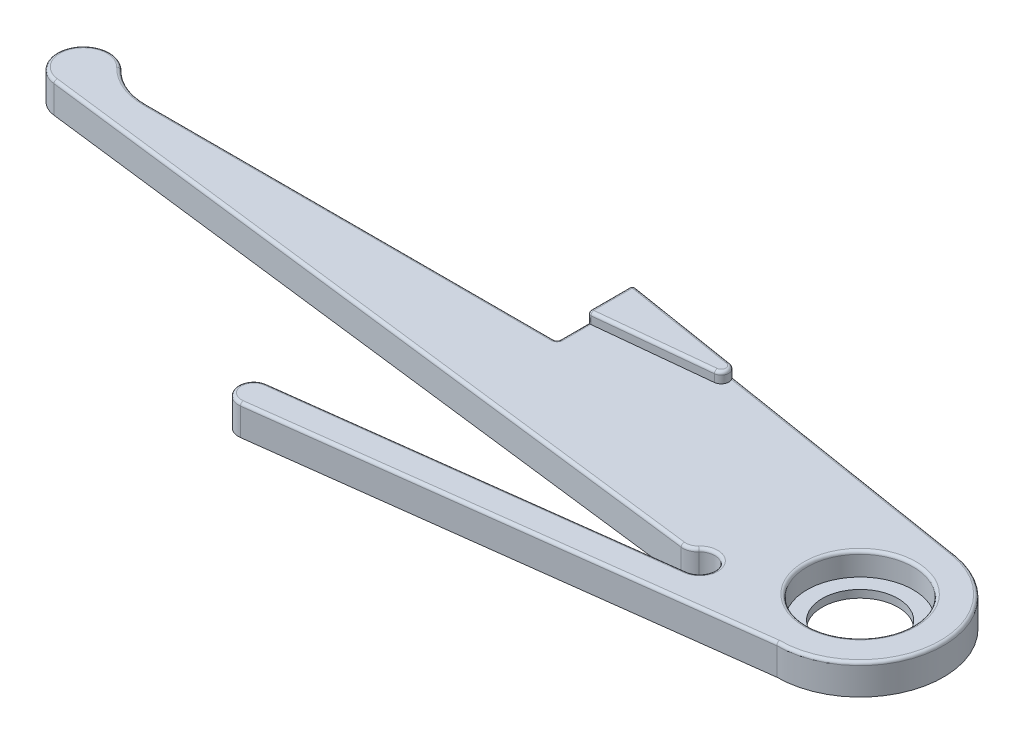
ISO-10303-21;
HEADER;
FILE_DESCRIPTION(('STEP AP214'),'2;1');
FILE_NAME('part.step','',(''),(''),'','','');
FILE_SCHEMA(('AUTOMOTIVE_DESIGN { 1 0 10303 214 1 1 1 1 }'));
ENDSEC;
DATA;
#1=APPLICATION_CONTEXT('core data for automotive mechanical design processes');
#2=APPLICATION_PROTOCOL_DEFINITION('international standard','automotive_design',2000,#1);
#3=PRODUCT_CONTEXT('',#1,'mechanical');
#4=PRODUCT('Part','Part','',(#3));
#5=PRODUCT_RELATED_PRODUCT_CATEGORY('part','',(#4));
#6=PRODUCT_DEFINITION_FORMATION('','',#4);
#7=PRODUCT_DEFINITION_CONTEXT('part definition',#1,'design');
#8=PRODUCT_DEFINITION('design','',#6,#7);
#9=PRODUCT_DEFINITION_SHAPE('','',#8);
#10=(LENGTH_UNIT() NAMED_UNIT(*) SI_UNIT(.MILLI.,.METRE.));
#11=(NAMED_UNIT(*) PLANE_ANGLE_UNIT() SI_UNIT($,.RADIAN.));
#12=(NAMED_UNIT(*) SI_UNIT($,.STERADIAN.) SOLID_ANGLE_UNIT());
#13=UNCERTAINTY_MEASURE_WITH_UNIT(LENGTH_MEASURE(1.E-05),#10,'distance_accuracy_value','');
#14=(GEOMETRIC_REPRESENTATION_CONTEXT(3) GLOBAL_UNCERTAINTY_ASSIGNED_CONTEXT((#13)) GLOBAL_UNIT_ASSIGNED_CONTEXT((#10,
#11,#12)) REPRESENTATION_CONTEXT('',''));
#15=CARTESIAN_POINT('',(0.,0.,0.));
#16=DIRECTION('',(0.,0.,1.));
#17=DIRECTION('',(1.,0.,0.));
#18=AXIS2_PLACEMENT_3D('',#15,#16,#17);
#19=CARTESIAN_POINT('',(0.,2.,0.));
#20=DIRECTION('',(0.,-1.,0.));
#21=DIRECTION('',(0.,0.,-1.));
#22=AXIS2_PLACEMENT_3D('',#19,#20,#21);
#23=CYLINDRICAL_SURFACE('',#22,2.5);
#24=CARTESIAN_POINT('',(0.,0.,0.));
#25=DIRECTION('',(0.,1.,0.));
#26=DIRECTION('',(0.,0.,1.));
#27=AXIS2_PLACEMENT_3D('',#24,#25,#26);
#28=CIRCLE('',#27,2.5);
#29=CARTESIAN_POINT('',(0.,0.,2.5));
#30=VERTEX_POINT('',#29);
#31=EDGE_CURVE('E239',#30,#30,#28,.T.);
#32=ORIENTED_EDGE('',*,*,#31,.F.);
#33=EDGE_LOOP('',(#32));
#34=FACE_BOUND('',#33,.T.);
#35=CARTESIAN_POINT('',(0.,0.5,0.));
#36=DIRECTION('',(0.,1.,0.));
#37=DIRECTION('',(0.,0.,1.));
#38=AXIS2_PLACEMENT_3D('',#35,#36,#37);
#39=CIRCLE('',#38,2.5);
#40=CARTESIAN_POINT('',(0.,0.5,2.5));
#41=VERTEX_POINT('',#40);
#42=EDGE_CURVE('E287',#41,#41,#39,.T.);
#43=ORIENTED_EDGE('',*,*,#42,.T.);
#44=EDGE_LOOP('',(#43));
#45=FACE_BOUND('',#44,.T.);
#46=ADVANCED_FACE('F37',(#34,#45),#23,.F.);
#47=CARTESIAN_POINT('',(-55.75,2.,-4.50451528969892));
#48=DIRECTION('',(0.,1.,0.));
#49=DIRECTION('',(0.,0.,1.));
#50=AXIS2_PLACEMENT_3D('',#47,#48,#49);
#51=PLANE('',#50);
#52=CARTESIAN_POINT('',(0.,2.,0.));
#53=DIRECTION('',(0.,1.,0.));
#54=DIRECTION('',(0.,0.,1.));
#55=AXIS2_PLACEMENT_3D('',#52,#53,#54);
#56=CIRCLE('',#55,3.7);
#57=CARTESIAN_POINT('',(0.,2.,3.7));
#58=VERTEX_POINT('',#57);
#59=EDGE_CURVE('E306',#58,#58,#56,.F.);
#60=ORIENTED_EDGE('',*,*,#59,.T.);
#61=EDGE_LOOP('',(#60));
#62=FACE_BOUND('',#61,.T.);
#63=CARTESIAN_POINT('',(0.,2.,0.));
#64=DIRECTION('',(0.,1.,0.));
#65=DIRECTION('',(0.,0.,1.));
#66=AXIS2_PLACEMENT_3D('',#63,#64,#65);
#67=CIRCLE('',#66,5.3);
#68=CARTESIAN_POINT('',(-0.0125778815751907,2.,5.29998507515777));
#69=VERTEX_POINT('',#68);
#70=CARTESIAN_POINT('',(0.83936984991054,2.,-5.23311171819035));
#71=VERTEX_POINT('',#70);
#72=EDGE_CURVE('E376',#69,#71,#67,.T.);
#73=ORIENTED_EDGE('',*,*,#72,.T.);
#74=DIRECTION('',(-0.987379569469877,0.,-0.158371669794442));
#75=VECTOR('',#74,1.);
#76=CARTESIAN_POINT('',(-16.8971665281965,2.,-8.07798006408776));
#77=LINE('',#76,#75);
#78=CARTESIAN_POINT('',(-16.5022147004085,2.,-8.01463139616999));
#79=VERTEX_POINT('',#78);
#80=EDGE_CURVE('E379',#71,#79,#77,.T.);
#81=ORIENTED_EDGE('',*,*,#80,.T.);
#82=CARTESIAN_POINT('',(-16.9446780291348,2.,-7.7817661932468));
#83=DIRECTION('',(0.,1.,0.));
#84=DIRECTION('',(0.,0.,1.));
#85=AXIS2_PLACEMENT_3D('',#82,#83,#84);
#86=CIRCLE('',#85,0.5);
#87=CARTESIAN_POINT('',(-16.8933893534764,2.,-7.28440367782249));
#88=VERTEX_POINT('',#87);
#89=EDGE_CURVE('E301',#79,#88,#86,.F.);
#90=ORIENTED_EDGE('',*,*,#89,.T.);
#91=DIRECTION('',(0.994725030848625,0.,-0.102577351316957));
#92=VECTOR('',#91,1.);
#93=CARTESIAN_POINT('',(-24.5,2.,-6.49999999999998));
#94=LINE('',#93,#92);
#95=CARTESIAN_POINT('',(-24.2794845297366,2.,-6.52273984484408));
#96=VERTEX_POINT('',#95);
#97=EDGE_CURVE('E290',#96,#88,#94,.T.);
#98=ORIENTED_EDGE('',*,*,#97,.F.);
#99=CARTESIAN_POINT('',(-24.3,2.,-6.7216848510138));
#100=DIRECTION('',(0.,1.,0.));
#101=DIRECTION('',(0.,0.,1.));
#102=AXIS2_PLACEMENT_3D('',#99,#100,#101);
#103=CIRCLE('',#102,0.2);
#104=CARTESIAN_POINT('',(-24.3,2.,-6.5216848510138));
#105=VERTEX_POINT('',#104);
#106=EDGE_CURVE('E321',#96,#105,#103,.F.);
#107=ORIENTED_EDGE('',*,*,#106,.T.);
#108=DIRECTION('',(0.,0.,1.));
#109=VECTOR('',#108,1.);
#110=CARTESIAN_POINT('',(-24.3,2.,-4.69999999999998));
#111=LINE('',#110,#109);
#112=CARTESIAN_POINT('',(-24.3,2.,-4.69999999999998));
#113=VERTEX_POINT('',#112);
#114=EDGE_CURVE('E374',#105,#113,#111,.T.);
#115=ORIENTED_EDGE('',*,*,#114,.T.);
#116=CARTESIAN_POINT('',(-24.7,2.,-4.69999999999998));
#117=DIRECTION('',(0.,1.,0.));
#118=DIRECTION('',(0.,0.,1.));
#119=AXIS2_PLACEMENT_3D('',#116,#117,#118);
#120=CIRCLE('',#119,0.4);
#121=CARTESIAN_POINT('',(-24.7,2.,-4.29999999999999));
#122=VERTEX_POINT('',#121);
#123=EDGE_CURVE('E372',#113,#122,#120,.F.);
#124=ORIENTED_EDGE('',*,*,#123,.T.);
#125=DIRECTION('',(-1.,0.,0.));
#126=VECTOR('',#125,1.);
#127=CARTESIAN_POINT('',(-51.6149544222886,2.,-4.29999999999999));
#128=LINE('',#127,#126);
#129=CARTESIAN_POINT('',(-51.6149544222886,2.,-4.29999999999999));
#130=VERTEX_POINT('',#129);
#131=EDGE_CURVE('E354',#122,#130,#128,.T.);
#132=ORIENTED_EDGE('',*,*,#131,.T.);
#133=CARTESIAN_POINT('',(-51.6149544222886,2.,-8.49999999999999));
#134=DIRECTION('',(0.,1.,0.));
#135=DIRECTION('',(0.,0.,1.));
#136=AXIS2_PLACEMENT_3D('',#133,#134,#135);
#137=CIRCLE('',#136,4.2);
#138=CARTESIAN_POINT('',(-54.6353355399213,2.,-5.58155899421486));
#139=VERTEX_POINT('',#138);
#140=EDGE_CURVE('E356',#130,#139,#137,.F.);
#141=ORIENTED_EDGE('',*,*,#140,.T.);
#142=CARTESIAN_POINT('',(-55.75,2.,-4.50451528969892));
#143=DIRECTION('',(0.,1.,0.));
#144=DIRECTION('',(0.,0.,1.));
#145=AXIS2_PLACEMENT_3D('',#142,#143,#144);
#146=CIRCLE('',#145,1.55);
#147=CARTESIAN_POINT('',(-55.938897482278,2.,-2.96606875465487));
#148=VERTEX_POINT('',#147);
#149=EDGE_CURVE('E358',#139,#148,#146,.T.);
#150=ORIENTED_EDGE('',*,*,#149,.T.);
#151=DIRECTION('',(0.992546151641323,0.,0.121869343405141));
#152=VECTOR('',#151,1.);
#153=CARTESIAN_POINT('',(-8.75799805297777,2.,2.82701726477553));
#154=LINE('',#153,#152);
#155=CARTESIAN_POINT('',(-8.75799805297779,2.,2.82701726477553));
#156=VERTEX_POINT('',#155);
#157=EDGE_CURVE('E360',#148,#156,#154,.T.);
#158=ORIENTED_EDGE('',*,*,#157,.T.);
#159=CARTESIAN_POINT('',(-8.66050257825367,2.,2.03298034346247));
#160=DIRECTION('',(0.,1.,0.));
#161=DIRECTION('',(0.,0.,1.));
#162=AXIS2_PLACEMENT_3D('',#159,#160,#161);
#163=CIRCLE('',#162,0.8);
#164=CARTESIAN_POINT('',(-8.07381864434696,2.,2.57685713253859));
#165=VERTEX_POINT('',#164);
#166=EDGE_CURVE('E362',#156,#165,#163,.T.);
#167=ORIENTED_EDGE('',*,*,#166,.T.);
#168=CARTESIAN_POINT('',(-7.1937927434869,2.,3.39267231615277));
#169=DIRECTION('',(0.,1.,0.));
#170=DIRECTION('',(0.,0.,1.));
#171=AXIS2_PLACEMENT_3D('',#168,#169,#170);
#172=CIRCLE('',#171,1.2);
#173=CARTESIAN_POINT('',(-7.04206439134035,2.,4.58304137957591));
#174=VERTEX_POINT('',#173);
#175=EDGE_CURVE('E364',#165,#174,#172,.F.);
#176=ORIENTED_EDGE('',*,*,#175,.T.);
#177=DIRECTION('',(-0.991974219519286,0.,0.126440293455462));
#178=VECTOR('',#177,1.);
#179=CARTESIAN_POINT('',(-31.6091780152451,2.,7.71444640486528));
#180=LINE('',#179,#178);
#181=CARTESIAN_POINT('',(-31.6091780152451,2.,7.71444640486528));
#182=VERTEX_POINT('',#181);
#183=EDGE_CURVE('E366',#174,#182,#180,.T.);
#184=ORIENTED_EDGE('',*,*,#183,.T.);
#185=CARTESIAN_POINT('',(-31.5080257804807,2.,8.50802578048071));
#186=DIRECTION('',(0.,1.,0.));
#187=DIRECTION('',(0.,0.,1.));
#188=AXIS2_PLACEMENT_3D('',#185,#186,#187);
#189=CIRCLE('',#188,0.800000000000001);
#190=CARTESIAN_POINT('',(-31.4068735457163,2.,9.30160515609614));
#191=VERTEX_POINT('',#190);
#192=EDGE_CURVE('E368',#182,#191,#189,.T.);
#193=ORIENTED_EDGE('',*,*,#192,.T.);
#194=DIRECTION('',(0.991974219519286,0.,-0.126440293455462));
#195=VECTOR('',#194,1.);
#196=CARTESIAN_POINT('',(-0.0252880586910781,2.,5.30160515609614));
#197=LINE('',#196,#195);
#198=EDGE_CURVE('E370',#191,#69,#197,.T.);
#199=ORIENTED_EDGE('',*,*,#198,.T.);
#200=EDGE_LOOP('',(#73,#81,#90,#98,#107,#115,#124,#132,#141,#150,#158,#167,#176,#184,#193,#199));
#201=FACE_BOUND('',#200,.T.);
#202=ADVANCED_FACE('F549',(#62,#201),#51,.T.);
#203=CARTESIAN_POINT('',(-55.75,0.,-4.50451528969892));
#204=DIRECTION('',(0.,1.,0.));
#205=DIRECTION('',(0.,0.,1.));
#206=AXIS2_PLACEMENT_3D('',#203,#204,#205);
#207=PLANE('',#206);
#208=DIRECTION('',(0.,0.,1.));
#209=VECTOR('',#208,1.);
#210=CARTESIAN_POINT('',(-24.5,0.,-9.49999999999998));
#211=LINE('',#210,#209);
#212=CARTESIAN_POINT('',(-24.5,0.,-9.26536446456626));
#213=VERTEX_POINT('',#212);
#214=CARTESIAN_POINT('',(-24.5,0.,-4.69999999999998));
#215=VERTEX_POINT('',#214);
#216=EDGE_CURVE('E269',#213,#215,#211,.T.);
#217=ORIENTED_EDGE('',*,*,#216,.F.);
#218=CARTESIAN_POINT('',(-24.3,0.,-9.26536446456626));
#219=DIRECTION('',(0.,1.,0.));
#220=DIRECTION('',(0.,0.,1.));
#221=AXIS2_PLACEMENT_3D('',#218,#219,#220);
#222=CIRCLE('',#221,0.2);
#223=CARTESIAN_POINT('',(-24.2683256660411,0.,-9.46284037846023));
#224=VERTEX_POINT('',#223);
#225=EDGE_CURVE('E316',#213,#224,#222,.F.);
#226=ORIENTED_EDGE('',*,*,#225,.T.);
#227=DIRECTION('',(-0.987379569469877,0.,-0.158371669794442));
#228=VECTOR('',#227,1.);
#229=CARTESIAN_POINT('',(-24.5,0.,-9.49999999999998));
#230=LINE('',#229,#228);
#231=CARTESIAN_POINT('',(0.871044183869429,0.,-5.43058763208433));
#232=VERTEX_POINT('',#231);
#233=EDGE_CURVE('E266',#232,#224,#230,.T.);
#234=ORIENTED_EDGE('',*,*,#233,.F.);
#235=CARTESIAN_POINT('',(0.,0.,0.));
#236=DIRECTION('',(0.,1.,0.));
#237=DIRECTION('',(0.,0.,1.));
#238=AXIS2_PLACEMENT_3D('',#235,#236,#237);
#239=CIRCLE('',#238,5.5);
#240=CARTESIAN_POINT('',(0.,0.,5.5));
#241=VERTEX_POINT('',#240);
#242=EDGE_CURVE('E263',#241,#232,#239,.T.);
#243=ORIENTED_EDGE('',*,*,#242,.F.);
#244=DIRECTION('',(0.991974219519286,0.,-0.126440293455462));
#245=VECTOR('',#244,1.);
#246=CARTESIAN_POINT('',(-31.3815854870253,0.,9.5));
#247=LINE('',#246,#245);
#248=CARTESIAN_POINT('',(-31.3815854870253,0.,9.5));
#249=VERTEX_POINT('',#248);
#250=EDGE_CURVE('E260',#249,#241,#247,.T.);
#251=ORIENTED_EDGE('',*,*,#250,.F.);
#252=CARTESIAN_POINT('',(-31.5080257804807,0.,8.50802578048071));
#253=DIRECTION('',(0.,1.,0.));
#254=DIRECTION('',(0.,0.,1.));
#255=AXIS2_PLACEMENT_3D('',#252,#253,#254);
#256=CIRCLE('',#255,1.);
#257=CARTESIAN_POINT('',(-31.6344660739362,0.,7.51605156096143));
#258=VERTEX_POINT('',#257);
#259=EDGE_CURVE('E257',#258,#249,#256,.T.);
#260=ORIENTED_EDGE('',*,*,#259,.F.);
#261=DIRECTION('',(-0.991974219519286,0.,0.126440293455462));
#262=VECTOR('',#261,1.);
#263=CARTESIAN_POINT('',(-7.06735245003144,0.,4.38464653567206));
#264=LINE('',#263,#262);
#265=CARTESIAN_POINT('',(-7.06735245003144,0.,4.38464653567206));
#266=VERTEX_POINT('',#265);
#267=EDGE_CURVE('E254',#266,#258,#264,.T.);
#268=ORIENTED_EDGE('',*,*,#267,.F.);
#269=CARTESIAN_POINT('',(-7.1937927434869,0.,3.39267231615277));
#270=DIRECTION('',(0.,-1.,0.));
#271=DIRECTION('',(0.,0.,-1.));
#272=AXIS2_PLACEMENT_3D('',#269,#270,#271);
#273=CIRCLE('',#272,1.);
#274=CARTESIAN_POINT('',(-7.92714766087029,0.,2.71282632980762));
#275=VERTEX_POINT('',#274);
#276=EDGE_CURVE('E248',#275,#266,#273,.T.);
#277=ORIENTED_EDGE('',*,*,#276,.F.);
#278=CARTESIAN_POINT('',(-8.66050257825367,0.,2.03298034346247));
#279=DIRECTION('',(0.,1.,0.));
#280=DIRECTION('',(0.,0.,1.));
#281=AXIS2_PLACEMENT_3D('',#278,#279,#280);
#282=CIRCLE('',#281,1.);
#283=CARTESIAN_POINT('',(-8.78237192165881,0.,3.02552649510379));
#284=VERTEX_POINT('',#283);
#285=EDGE_CURVE('E246',#284,#275,#282,.T.);
#286=ORIENTED_EDGE('',*,*,#285,.F.);
#287=DIRECTION('',(0.992546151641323,0.,0.121869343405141));
#288=VECTOR('',#287,1.);
#289=CARTESIAN_POINT('',(-55.963271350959,0.,-2.7675595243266));
#290=LINE('',#289,#288);
#291=CARTESIAN_POINT('',(-55.963271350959,0.,-2.7675595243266));
#292=VERTEX_POINT('',#291);
#293=EDGE_CURVE('E224',#292,#284,#290,.T.);
#294=ORIENTED_EDGE('',*,*,#293,.F.);
#295=CARTESIAN_POINT('',(-55.75,0.,-4.50451528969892));
#296=DIRECTION('',(0.,1.,0.));
#297=DIRECTION('',(0.,0.,1.));
#298=AXIS2_PLACEMENT_3D('',#295,#296,#297);
#299=CIRCLE('',#298,1.75);
#300=CARTESIAN_POINT('',(-54.4915078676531,0.,-5.72053237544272));
#301=VERTEX_POINT('',#300);
#302=EDGE_CURVE('E234',#301,#292,#299,.T.);
#303=ORIENTED_EDGE('',*,*,#302,.F.);
#304=CARTESIAN_POINT('',(-51.6149544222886,0.,-8.49999999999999));
#305=DIRECTION('',(0.,1.,0.));
#306=DIRECTION('',(0.,0.,1.));
#307=AXIS2_PLACEMENT_3D('',#304,#305,#306);
#308=CIRCLE('',#307,4.);
#309=CARTESIAN_POINT('',(-51.6149544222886,0.,-4.49999999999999));
#310=VERTEX_POINT('',#309);
#311=EDGE_CURVE('E295',#301,#310,#308,.T.);
#312=ORIENTED_EDGE('',*,*,#311,.T.);
#313=DIRECTION('',(-1.,0.,0.));
#314=VECTOR('',#313,1.);
#315=CARTESIAN_POINT('',(-24.5,0.,-4.49999999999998));
#316=LINE('',#315,#314);
#317=CARTESIAN_POINT('',(-24.7,0.,-4.49999999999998));
#318=VERTEX_POINT('',#317);
#319=EDGE_CURVE('E272',#318,#310,#316,.T.);
#320=ORIENTED_EDGE('',*,*,#319,.F.);
#321=CARTESIAN_POINT('',(-24.7,0.,-4.69999999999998));
#322=DIRECTION('',(0.,1.,0.));
#323=DIRECTION('',(0.,0.,1.));
#324=AXIS2_PLACEMENT_3D('',#321,#322,#323);
#325=CIRCLE('',#324,0.2);
#326=EDGE_CURVE('E329',#318,#215,#325,.T.);
#327=ORIENTED_EDGE('',*,*,#326,.T.);
#328=EDGE_LOOP('',(#217,#226,#234,#243,#251,#260,#268,#277,#286,#294,#303,#312,#320,#327));
#329=FACE_BOUND('',#328,.T.);
#330=ORIENTED_EDGE('',*,*,#31,.T.);
#331=EDGE_LOOP('',(#330));
#332=FACE_BOUND('',#331,.T.);
#333=ADVANCED_FACE('F242',(#329,#332),#207,.F.);
#334=CARTESIAN_POINT('',(-55.75,2.,-4.50451528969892));
#335=DIRECTION('',(0.,-1.,0.));
#336=DIRECTION('',(0.,0.,-1.));
#337=AXIS2_PLACEMENT_3D('',#334,#335,#336);
#338=CYLINDRICAL_SURFACE('',#337,1.75);
#339=DIRECTION('',(0.,-1.,0.));
#340=VECTOR('',#339,1.);
#341=CARTESIAN_POINT('',(-55.963271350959,2.,-2.7675595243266));
#342=LINE('',#341,#340);
#343=CARTESIAN_POINT('',(-55.963271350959,1.8,-2.7675595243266));
#344=VERTEX_POINT('',#343);
#345=EDGE_CURVE('E219',#344,#292,#342,.T.);
#346=ORIENTED_EDGE('',*,*,#345,.F.);
#347=CARTESIAN_POINT('',(-55.75,1.8,-4.50451528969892));
#348=DIRECTION('',(0.,1.,0.));
#349=DIRECTION('',(0.,0.,1.));
#350=AXIS2_PLACEMENT_3D('',#347,#348,#349);
#351=CIRCLE('',#350,1.75);
#352=CARTESIAN_POINT('',(-54.4915078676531,1.8,-5.72053237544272));
#353=VERTEX_POINT('',#352);
#354=EDGE_CURVE('E396',#344,#353,#351,.F.);
#355=ORIENTED_EDGE('',*,*,#354,.T.);
#356=DIRECTION('',(0.,-1.,0.));
#357=VECTOR('',#356,1.);
#358=CARTESIAN_POINT('',(-54.4915078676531,2.,-5.72053237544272));
#359=LINE('',#358,#357);
#360=EDGE_CURVE('E230',#353,#301,#359,.T.);
#361=ORIENTED_EDGE('',*,*,#360,.T.);
#362=ORIENTED_EDGE('',*,*,#302,.T.);
#363=EDGE_LOOP('',(#346,#355,#361,#362));
#364=FACE_BOUND('',#363,.T.);
#365=ADVANCED_FACE('F235',(#364),#338,.T.);
#366=CARTESIAN_POINT('',(-55.963271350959,2.,-2.7675595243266));
#367=DIRECTION('',(0.121869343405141,0.,-0.992546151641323));
#368=DIRECTION('',(-0.992546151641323,0.,-0.121869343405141));
#369=AXIS2_PLACEMENT_3D('',#366,#367,#368);
#370=PLANE('',#369);
#371=DIRECTION('',(0.,-1.,0.));
#372=VECTOR('',#371,1.);
#373=CARTESIAN_POINT('',(-8.78237192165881,2.,3.02552649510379));
#374=LINE('',#373,#372);
#375=CARTESIAN_POINT('',(-8.78237192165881,1.8,3.02552649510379));
#376=VERTEX_POINT('',#375);
#377=EDGE_CURVE('E231',#376,#284,#374,.T.);
#378=ORIENTED_EDGE('',*,*,#377,.F.);
#379=DIRECTION('',(0.992546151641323,0.,0.121869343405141));
#380=VECTOR('',#379,1.);
#381=CARTESIAN_POINT('',(-55.963271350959,1.8,-2.7675595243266));
#382=LINE('',#381,#380);
#383=EDGE_CURVE('E227',#376,#344,#382,.F.);
#384=ORIENTED_EDGE('',*,*,#383,.T.);
#385=ORIENTED_EDGE('',*,*,#345,.T.);
#386=ORIENTED_EDGE('',*,*,#293,.T.);
#387=EDGE_LOOP('',(#378,#384,#385,#386));
#388=FACE_BOUND('',#387,.T.);
#389=ADVANCED_FACE('F222',(#388),#370,.F.);
#390=CARTESIAN_POINT('',(-8.66050257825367,2.,2.03298034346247));
#391=DIRECTION('',(0.,-1.,0.));
#392=DIRECTION('',(0.,0.,-1.));
#393=AXIS2_PLACEMENT_3D('',#390,#391,#392);
#394=CYLINDRICAL_SURFACE('',#393,1.);
#395=DIRECTION('',(0.,-1.,0.));
#396=VECTOR('',#395,1.);
#397=CARTESIAN_POINT('',(-7.92714766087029,2.,2.71282632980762));
#398=LINE('',#397,#396);
#399=CARTESIAN_POINT('',(-7.92714766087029,1.8,2.71282632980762));
#400=VERTEX_POINT('',#399);
#401=EDGE_CURVE('E284',#400,#275,#398,.T.);
#402=ORIENTED_EDGE('',*,*,#401,.F.);
#403=CARTESIAN_POINT('',(-8.66050257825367,1.8,2.03298034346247));
#404=DIRECTION('',(0.,1.,0.));
#405=DIRECTION('',(0.,0.,1.));
#406=AXIS2_PLACEMENT_3D('',#403,#404,#405);
#407=CIRCLE('',#406,1.);
#408=EDGE_CURVE('E393',#400,#376,#407,.F.);
#409=ORIENTED_EDGE('',*,*,#408,.T.);
#410=ORIENTED_EDGE('',*,*,#377,.T.);
#411=ORIENTED_EDGE('',*,*,#285,.T.);
#412=EDGE_LOOP('',(#402,#409,#410,#411));
#413=FACE_BOUND('',#412,.T.);
#414=ADVANCED_FACE('F607',(#413),#394,.T.);
#415=CARTESIAN_POINT('',(-7.1937927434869,2.,3.39267231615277));
#416=DIRECTION('',(0.,-1.,0.));
#417=DIRECTION('',(0.,0.,-1.));
#418=AXIS2_PLACEMENT_3D('',#415,#416,#417);
#419=CYLINDRICAL_SURFACE('',#418,1.);
#420=DIRECTION('',(0.,-1.,0.));
#421=VECTOR('',#420,1.);
#422=CARTESIAN_POINT('',(-7.06735245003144,2.,4.38464653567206));
#423=LINE('',#422,#421);
#424=CARTESIAN_POINT('',(-7.06735245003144,1.8,4.38464653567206));
#425=VERTEX_POINT('',#424);
#426=EDGE_CURVE('E282',#425,#266,#423,.T.);
#427=ORIENTED_EDGE('',*,*,#426,.F.);
#428=CARTESIAN_POINT('',(-7.1937927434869,1.8,3.39267231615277));
#429=DIRECTION('',(0.,1.,0.));
#430=DIRECTION('',(0.,0.,1.));
#431=AXIS2_PLACEMENT_3D('',#428,#429,#430);
#432=CIRCLE('',#431,1.);
#433=EDGE_CURVE('E391',#425,#400,#432,.T.);
#434=ORIENTED_EDGE('',*,*,#433,.T.);
#435=ORIENTED_EDGE('',*,*,#401,.T.);
#436=ORIENTED_EDGE('',*,*,#276,.T.);
#437=EDGE_LOOP('',(#427,#434,#435,#436));
#438=FACE_BOUND('',#437,.T.);
#439=ADVANCED_FACE('F603',(#438),#419,.F.);
#440=CARTESIAN_POINT('',(-7.06735245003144,2.,4.38464653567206));
#441=DIRECTION('',(0.126440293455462,0.,0.991974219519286));
#442=DIRECTION('',(0.991974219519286,0.,-0.126440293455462));
#443=AXIS2_PLACEMENT_3D('',#440,#441,#442);
#444=PLANE('',#443);
#445=DIRECTION('',(0.,-1.,0.));
#446=VECTOR('',#445,1.);
#447=CARTESIAN_POINT('',(-31.6344660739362,2.,7.51605156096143));
#448=LINE('',#447,#446);
#449=CARTESIAN_POINT('',(-31.6344660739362,1.8,7.51605156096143));
#450=VERTEX_POINT('',#449);
#451=EDGE_CURVE('E280',#450,#258,#448,.T.);
#452=ORIENTED_EDGE('',*,*,#451,.F.);
#453=DIRECTION('',(-0.991974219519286,0.,0.126440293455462));
#454=VECTOR('',#453,1.);
#455=CARTESIAN_POINT('',(-7.06735245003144,1.8,4.38464653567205));
#456=LINE('',#455,#454);
#457=EDGE_CURVE('E389',#450,#425,#456,.F.);
#458=ORIENTED_EDGE('',*,*,#457,.T.);
#459=ORIENTED_EDGE('',*,*,#426,.T.);
#460=ORIENTED_EDGE('',*,*,#267,.T.);
#461=EDGE_LOOP('',(#452,#458,#459,#460));
#462=FACE_BOUND('',#461,.T.);
#463=ADVANCED_FACE('F599',(#462),#444,.F.);
#464=CARTESIAN_POINT('',(-31.5080257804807,2.,8.50802578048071));
#465=DIRECTION('',(0.,-1.,0.));
#466=DIRECTION('',(0.,0.,-1.));
#467=AXIS2_PLACEMENT_3D('',#464,#465,#466);
#468=CYLINDRICAL_SURFACE('',#467,1.);
#469=DIRECTION('',(0.,-1.,0.));
#470=VECTOR('',#469,1.);
#471=CARTESIAN_POINT('',(-31.3815854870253,2.,9.5));
#472=LINE('',#471,#470);
#473=CARTESIAN_POINT('',(-31.3815854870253,1.8,9.5));
#474=VERTEX_POINT('',#473);
#475=EDGE_CURVE('E278',#474,#249,#472,.T.);
#476=ORIENTED_EDGE('',*,*,#475,.F.);
#477=CARTESIAN_POINT('',(-31.5080257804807,1.8,8.50802578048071));
#478=DIRECTION('',(0.,1.,0.));
#479=DIRECTION('',(0.,0.,1.));
#480=AXIS2_PLACEMENT_3D('',#477,#478,#479);
#481=CIRCLE('',#480,1.);
#482=EDGE_CURVE('E387',#474,#450,#481,.F.);
#483=ORIENTED_EDGE('',*,*,#482,.T.);
#484=ORIENTED_EDGE('',*,*,#451,.T.);
#485=ORIENTED_EDGE('',*,*,#259,.T.);
#486=EDGE_LOOP('',(#476,#483,#484,#485));
#487=FACE_BOUND('',#486,.T.);
#488=ADVANCED_FACE('F595',(#487),#468,.T.);
#489=CARTESIAN_POINT('',(-31.3815854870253,2.,9.5));
#490=DIRECTION('',(-0.126440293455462,0.,-0.991974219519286));
#491=DIRECTION('',(-0.991974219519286,0.,0.126440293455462));
#492=AXIS2_PLACEMENT_3D('',#489,#490,#491);
#493=PLANE('',#492);
#494=DIRECTION('',(0.,-1.,0.));
#495=VECTOR('',#494,1.);
#496=CARTESIAN_POINT('',(0.,2.,5.5));
#497=LINE('',#496,#495);
#498=CARTESIAN_POINT('',(0.,1.8,5.5));
#499=VERTEX_POINT('',#498);
#500=EDGE_CURVE('E276',#499,#241,#497,.T.);
#501=ORIENTED_EDGE('',*,*,#500,.F.);
#502=DIRECTION('',(0.991974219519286,0.,-0.126440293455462));
#503=VECTOR('',#502,1.);
#504=CARTESIAN_POINT('',(-31.3815854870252,1.8,9.5));
#505=LINE('',#504,#503);
#506=EDGE_CURVE('E385',#499,#474,#505,.F.);
#507=ORIENTED_EDGE('',*,*,#506,.T.);
#508=ORIENTED_EDGE('',*,*,#475,.T.);
#509=ORIENTED_EDGE('',*,*,#250,.T.);
#510=EDGE_LOOP('',(#501,#507,#508,#509));
#511=FACE_BOUND('',#510,.T.);
#512=ADVANCED_FACE('F591',(#511),#493,.F.);
#513=CARTESIAN_POINT('',(0.,2.,0.));
#514=DIRECTION('',(0.,-1.,0.));
#515=DIRECTION('',(0.,0.,-1.));
#516=AXIS2_PLACEMENT_3D('',#513,#514,#515);
#517=CYLINDRICAL_SURFACE('',#516,5.5);
#518=DIRECTION('',(0.,-1.,0.));
#519=VECTOR('',#518,1.);
#520=CARTESIAN_POINT('',(0.871044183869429,2.,-5.43058763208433));
#521=LINE('',#520,#519);
#522=CARTESIAN_POINT('',(0.871044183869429,1.8,-5.43058763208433));
#523=VERTEX_POINT('',#522);
#524=EDGE_CURVE('E274',#523,#232,#521,.T.);
#525=ORIENTED_EDGE('',*,*,#524,.F.);
#526=CARTESIAN_POINT('',(0.,1.8,0.));
#527=DIRECTION('',(0.,1.,0.));
#528=DIRECTION('',(0.,0.,1.));
#529=AXIS2_PLACEMENT_3D('',#526,#527,#528);
#530=CIRCLE('',#529,5.5);
#531=EDGE_CURVE('E381',#523,#499,#530,.F.);
#532=ORIENTED_EDGE('',*,*,#531,.T.);
#533=ORIENTED_EDGE('',*,*,#500,.T.);
#534=ORIENTED_EDGE('',*,*,#242,.T.);
#535=EDGE_LOOP('',(#525,#532,#533,#534));
#536=FACE_BOUND('',#535,.T.);
#537=ADVANCED_FACE('F588',(#536),#517,.T.);
#538=CARTESIAN_POINT('',(-24.5,2.,-9.49999999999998));
#539=DIRECTION('',(-0.158371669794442,0.,0.987379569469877));
#540=DIRECTION('',(0.987379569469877,0.,0.158371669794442));
#541=AXIS2_PLACEMENT_3D('',#538,#539,#540);
#542=PLANE('',#541);
#543=DIRECTION('',(0.,-1.,0.));
#544=VECTOR('',#543,1.);
#545=CARTESIAN_POINT('',(-24.2683256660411,2.,-9.46284037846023));
#546=LINE('',#545,#544);
#547=CARTESIAN_POINT('',(-24.2683256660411,2.5,-9.46284037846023));
#548=VERTEX_POINT('',#547);
#549=EDGE_CURVE('E318',#224,#548,#546,.F.);
#550=ORIENTED_EDGE('',*,*,#549,.T.);
#551=DIRECTION('',(-0.987379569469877,0.,-0.158371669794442));
#552=VECTOR('',#551,1.);
#553=CARTESIAN_POINT('',(-24.5,2.5,-9.49999999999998));
#554=LINE('',#553,#552);
#555=CARTESIAN_POINT('',(-16.8654921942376,2.5,-8.27545597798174));
#556=VERTEX_POINT('',#555);
#557=EDGE_CURVE('E401',#548,#556,#554,.F.);
#558=ORIENTED_EDGE('',*,*,#557,.T.);
#559=DIRECTION('',(0.,-1.,0.));
#560=VECTOR('',#559,1.);
#561=CARTESIAN_POINT('',(-16.8654921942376,2.,-8.27545597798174));
#562=LINE('',#561,#560);
#563=CARTESIAN_POINT('',(-16.8654921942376,1.8,-8.27545597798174));
#564=VERTEX_POINT('',#563);
#565=EDGE_CURVE('E54',#556,#564,#562,.T.);
#566=ORIENTED_EDGE('',*,*,#565,.T.);
#567=DIRECTION('',(-0.987379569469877,0.,-0.158371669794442));
#568=VECTOR('',#567,1.);
#569=CARTESIAN_POINT('',(0.871044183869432,1.8,-5.43058763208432));
#570=LINE('',#569,#568);
#571=EDGE_CURVE('E399',#564,#523,#570,.F.);
#572=ORIENTED_EDGE('',*,*,#571,.T.);
#573=ORIENTED_EDGE('',*,*,#524,.T.);
#574=ORIENTED_EDGE('',*,*,#233,.T.);
#575=EDGE_LOOP('',(#550,#558,#566,#572,#573,#574));
#576=FACE_BOUND('',#575,.T.);
#577=ADVANCED_FACE('F584',(#576),#542,.F.);
#578=CARTESIAN_POINT('',(-24.5,2.,-9.49999999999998));
#579=DIRECTION('',(1.,0.,0.));
#580=DIRECTION('',(0.,0.,-1.));
#581=AXIS2_PLACEMENT_3D('',#578,#579,#580);
#582=PLANE('',#581);
#583=DIRECTION('',(0.,-1.,0.));
#584=VECTOR('',#583,1.);
#585=CARTESIAN_POINT('',(-24.5,2.,-6.7216848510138));
#586=LINE('',#585,#584);
#587=CARTESIAN_POINT('',(-24.5,1.8,-6.7216848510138));
#588=VERTEX_POINT('',#587);
#589=CARTESIAN_POINT('',(-24.5,2.5,-6.7216848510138));
#590=VERTEX_POINT('',#589);
#591=EDGE_CURVE('E313',#588,#590,#586,.F.);
#592=ORIENTED_EDGE('',*,*,#591,.T.);
#593=DIRECTION('',(0.,0.,1.));
#594=VECTOR('',#593,1.);
#595=CARTESIAN_POINT('',(-24.5,2.5,-9.49999999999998));
#596=LINE('',#595,#594);
#597=CARTESIAN_POINT('',(-24.5,2.5,-9.26536446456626));
#598=VERTEX_POINT('',#597);
#599=EDGE_CURVE('E350',#590,#598,#596,.F.);
#600=ORIENTED_EDGE('',*,*,#599,.T.);
#601=DIRECTION('',(0.,-1.,0.));
#602=VECTOR('',#601,1.);
#603=CARTESIAN_POINT('',(-24.5,2.,-9.26536446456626));
#604=LINE('',#603,#602);
#605=EDGE_CURVE('E311',#598,#213,#604,.T.);
#606=ORIENTED_EDGE('',*,*,#605,.T.);
#607=ORIENTED_EDGE('',*,*,#216,.T.);
#608=DIRECTION('',(0.,-1.,0.));
#609=VECTOR('',#608,1.);
#610=CARTESIAN_POINT('',(-24.5,2.,-4.69999999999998));
#611=LINE('',#610,#609);
#612=CARTESIAN_POINT('',(-24.5,1.8,-4.69999999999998));
#613=VERTEX_POINT('',#612);
#614=EDGE_CURVE('E326',#215,#613,#611,.F.);
#615=ORIENTED_EDGE('',*,*,#614,.T.);
#616=DIRECTION('',(0.,0.,1.));
#617=VECTOR('',#616,1.);
#618=CARTESIAN_POINT('',(-24.5,1.8,-6.7216848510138));
#619=LINE('',#618,#617);
#620=EDGE_CURVE('E347',#613,#588,#619,.F.);
#621=ORIENTED_EDGE('',*,*,#620,.T.);
#622=EDGE_LOOP('',(#592,#600,#606,#607,#615,#621));
#623=FACE_BOUND('',#622,.T.);
#624=ADVANCED_FACE('F580',(#623),#582,.F.);
#625=CARTESIAN_POINT('',(-24.5,2.,-4.49999999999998));
#626=DIRECTION('',(0.,0.,1.));
#627=DIRECTION('',(1.,0.,0.));
#628=AXIS2_PLACEMENT_3D('',#625,#626,#627);
#629=PLANE('',#628);
#630=DIRECTION('',(0.,1.,0.));
#631=VECTOR('',#630,1.);
#632=CARTESIAN_POINT('',(-51.6149544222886,2.,-4.49999999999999));
#633=LINE('',#632,#631);
#634=CARTESIAN_POINT('',(-51.6149544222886,1.8,-4.49999999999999));
#635=VERTEX_POINT('',#634);
#636=EDGE_CURVE('E293',#310,#635,#633,.T.);
#637=ORIENTED_EDGE('',*,*,#636,.T.);
#638=DIRECTION('',(-1.,0.,0.));
#639=VECTOR('',#638,1.);
#640=CARTESIAN_POINT('',(-24.7,1.8,-4.49999999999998));
#641=LINE('',#640,#639);
#642=CARTESIAN_POINT('',(-24.7,1.8,-4.49999999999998));
#643=VERTEX_POINT('',#642);
#644=EDGE_CURVE('E403',#635,#643,#641,.F.);
#645=ORIENTED_EDGE('',*,*,#644,.T.);
#646=DIRECTION('',(0.,-1.,0.));
#647=VECTOR('',#646,1.);
#648=CARTESIAN_POINT('',(-24.7,0.,-4.49999999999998));
#649=LINE('',#648,#647);
#650=EDGE_CURVE('E324',#643,#318,#649,.T.);
#651=ORIENTED_EDGE('',*,*,#650,.T.);
#652=ORIENTED_EDGE('',*,*,#319,.T.);
#653=EDGE_LOOP('',(#637,#645,#651,#652));
#654=FACE_BOUND('',#653,.T.);
#655=ADVANCED_FACE('F570',(#654),#629,.F.);
#656=CARTESIAN_POINT('',(-24.5,2.7,-6.49999999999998));
#657=DIRECTION('',(-0.102577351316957,0.,-0.994725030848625));
#658=DIRECTION('',(-0.994725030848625,0.,0.102577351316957));
#659=AXIS2_PLACEMENT_3D('',#656,#657,#658);
#660=PLANE('',#659);
#661=DIRECTION('',(0.,-1.,0.));
#662=VECTOR('',#661,1.);
#663=CARTESIAN_POINT('',(-16.8933893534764,2.7,-7.28440367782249));
#664=LINE('',#663,#662);
#665=CARTESIAN_POINT('',(-16.8933893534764,2.5,-7.28440367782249));
#666=VERTEX_POINT('',#665);
#667=EDGE_CURVE('E298',#88,#666,#664,.F.);
#668=ORIENTED_EDGE('',*,*,#667,.T.);
#669=DIRECTION('',(0.994725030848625,0.,-0.102577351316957));
#670=VECTOR('',#669,1.);
#671=CARTESIAN_POINT('',(-24.5,2.5,-6.49999999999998));
#672=LINE('',#671,#670);
#673=CARTESIAN_POINT('',(-24.2794845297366,2.5,-6.52273984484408));
#674=VERTEX_POINT('',#673);
#675=EDGE_CURVE('E343',#666,#674,#672,.F.);
#676=ORIENTED_EDGE('',*,*,#675,.T.);
#677=DIRECTION('',(0.,-1.,0.));
#678=VECTOR('',#677,1.);
#679=CARTESIAN_POINT('',(-24.2794845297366,2.7,-6.52273984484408));
#680=LINE('',#679,#678);
#681=EDGE_CURVE('E309',#674,#96,#680,.T.);
#682=ORIENTED_EDGE('',*,*,#681,.T.);
#683=ORIENTED_EDGE('',*,*,#97,.T.);
#684=EDGE_LOOP('',(#668,#676,#682,#683));
#685=FACE_BOUND('',#684,.T.);
#686=ADVANCED_FACE('F567',(#685),#660,.F.);
#687=CARTESIAN_POINT('',(0.,2.7,0.));
#688=DIRECTION('',(0.,-1.,0.));
#689=DIRECTION('',(0.,0.,-1.));
#690=AXIS2_PLACEMENT_3D('',#687,#688,#689);
#691=PLANE('',#690);
#692=DIRECTION('',(0.994725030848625,0.,-0.102577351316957));
#693=VECTOR('',#692,1.);
#694=CARTESIAN_POINT('',(-0.9415429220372,2.7,-9.13043961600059));
#695=LINE('',#694,#693);
#696=CARTESIAN_POINT('',(-24.3,2.7,-6.7216848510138));
#697=VERTEX_POINT('',#696);
#698=CARTESIAN_POINT('',(-16.9139048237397,2.7,-7.48334868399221));
#699=VERTEX_POINT('',#698);
#700=EDGE_CURVE('E335',#697,#699,#695,.T.);
#701=ORIENTED_EDGE('',*,*,#700,.T.);
#702=CARTESIAN_POINT('',(-16.9446780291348,2.7,-7.7817661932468));
#703=DIRECTION('',(0.,-1.,0.));
#704=DIRECTION('',(0.,0.,-1.));
#705=AXIS2_PLACEMENT_3D('',#702,#703,#704);
#706=CIRCLE('',#705,0.3);
#707=CARTESIAN_POINT('',(-16.8971665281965,2.7,-8.07798006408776));
#708=VERTEX_POINT('',#707);
#709=EDGE_CURVE('E337',#699,#708,#706,.F.);
#710=ORIENTED_EDGE('',*,*,#709,.T.);
#711=DIRECTION('',(-0.987379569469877,0.,-0.158371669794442));
#712=VECTOR('',#711,1.);
#713=CARTESIAN_POINT('',(0.839369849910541,2.7,-5.23311171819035));
#714=LINE('',#713,#712);
#715=CARTESIAN_POINT('',(-24.3,2.7,-9.26536446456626));
#716=VERTEX_POINT('',#715);
#717=EDGE_CURVE('E331',#708,#716,#714,.T.);
#718=ORIENTED_EDGE('',*,*,#717,.T.);
#719=DIRECTION('',(0.,0.,1.));
#720=VECTOR('',#719,1.);
#721=CARTESIAN_POINT('',(-24.3,2.7,0.));
#722=LINE('',#721,#720);
#723=EDGE_CURVE('E333',#716,#697,#722,.T.);
#724=ORIENTED_EDGE('',*,*,#723,.T.);
#725=EDGE_LOOP('',(#701,#710,#718,#724));
#726=FACE_BOUND('',#725,.T.);
#727=ADVANCED_FACE('F561',(#726),#691,.F.);
#728=CARTESIAN_POINT('',(0.,0.5,0.));
#729=DIRECTION('',(0.,1.,0.));
#730=DIRECTION('',(0.,0.,1.));
#731=AXIS2_PLACEMENT_3D('',#728,#729,#730);
#732=CYLINDRICAL_SURFACE('',#731,3.5);
#733=CARTESIAN_POINT('',(0.,1.8,0.));
#734=DIRECTION('',(0.,1.,0.));
#735=DIRECTION('',(0.,0.,1.));
#736=AXIS2_PLACEMENT_3D('',#733,#734,#735);
#737=CIRCLE('',#736,3.5);
#738=CARTESIAN_POINT('',(0.,1.8,3.5));
#739=VERTEX_POINT('',#738);
#740=EDGE_CURVE('E303',#739,#739,#737,.T.);
#741=ORIENTED_EDGE('',*,*,#740,.T.);
#742=EDGE_LOOP('',(#741));
#743=FACE_BOUND('',#742,.T.);
#744=CARTESIAN_POINT('',(0.,0.5,0.));
#745=DIRECTION('',(0.,1.,0.));
#746=DIRECTION('',(0.,0.,1.));
#747=AXIS2_PLACEMENT_3D('',#744,#745,#746);
#748=CIRCLE('',#747,3.5);
#749=CARTESIAN_POINT('',(0.,0.5,3.5));
#750=VERTEX_POINT('',#749);
#751=EDGE_CURVE('E291',#750,#750,#748,.T.);
#752=ORIENTED_EDGE('',*,*,#751,.F.);
#753=EDGE_LOOP('',(#752));
#754=FACE_BOUND('',#753,.T.);
#755=ADVANCED_FACE('F555',(#743,#754),#732,.F.);
#756=CARTESIAN_POINT('',(0.,0.5,0.));
#757=DIRECTION('',(0.,1.,0.));
#758=DIRECTION('',(0.,0.,1.));
#759=AXIS2_PLACEMENT_3D('',#756,#757,#758);
#760=PLANE('',#759);
#761=ORIENTED_EDGE('',*,*,#42,.F.);
#762=EDGE_LOOP('',(#761));
#763=FACE_BOUND('',#762,.T.);
#764=ORIENTED_EDGE('',*,*,#751,.T.);
#765=EDGE_LOOP('',(#764));
#766=FACE_BOUND('',#765,.T.);
#767=ADVANCED_FACE('F553',(#763,#766),#760,.T.);
#768=CARTESIAN_POINT('',(-51.6149544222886,2.,-8.49999999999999));
#769=DIRECTION('',(0.,-1.,0.));
#770=DIRECTION('',(0.,0.,-1.));
#771=AXIS2_PLACEMENT_3D('',#768,#769,#770);
#772=CYLINDRICAL_SURFACE('',#771,4.);
#773=ORIENTED_EDGE('',*,*,#360,.F.);
#774=CARTESIAN_POINT('',(-51.6149544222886,1.8,-8.49999999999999));
#775=DIRECTION('',(0.,1.,0.));
#776=DIRECTION('',(0.,0.,1.));
#777=AXIS2_PLACEMENT_3D('',#774,#775,#776);
#778=CIRCLE('',#777,4.);
#779=EDGE_CURVE('E61',#353,#635,#778,.T.);
#780=ORIENTED_EDGE('',*,*,#779,.T.);
#781=ORIENTED_EDGE('',*,*,#636,.F.);
#782=ORIENTED_EDGE('',*,*,#311,.F.);
#783=EDGE_LOOP('',(#773,#780,#781,#782));
#784=FACE_BOUND('',#783,.T.);
#785=ADVANCED_FACE('F424',(#784),#772,.F.);
#786=CARTESIAN_POINT('',(-16.9446780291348,2.,-7.7817661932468));
#787=DIRECTION('',(0.,-1.,0.));
#788=DIRECTION('',(0.,0.,-1.));
#789=AXIS2_PLACEMENT_3D('',#786,#787,#788);
#790=CYLINDRICAL_SURFACE('',#789,0.5);
#791=ORIENTED_EDGE('',*,*,#565,.F.);
#792=CARTESIAN_POINT('',(-16.9446780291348,2.5,-7.7817661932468));
#793=DIRECTION('',(0.,-1.,0.));
#794=DIRECTION('',(0.,0.,-1.));
#795=AXIS2_PLACEMENT_3D('',#792,#793,#794);
#796=CIRCLE('',#795,0.5);
#797=EDGE_CURVE('E340',#556,#666,#796,.T.);
#798=ORIENTED_EDGE('',*,*,#797,.T.);
#799=ORIENTED_EDGE('',*,*,#667,.F.);
#800=ORIENTED_EDGE('',*,*,#89,.F.);
#801=CARTESIAN_POINT('',(-16.5022147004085,2.,-8.01463139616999));
#802=CARTESIAN_POINT('',(-16.5101809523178,1.99998175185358,-8.02979520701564));
#803=CARTESIAN_POINT('',(-16.5189032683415,1.99859578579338,-8.04445313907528));
#804=CARTESIAN_POINT('',(-16.5375059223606,1.99366878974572,-8.0724323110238));
#805=CARTESIAN_POINT('',(-16.5473740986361,1.99014897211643,-8.08576522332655));
#806=CARTESIAN_POINT('',(-16.5724742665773,1.97967988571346,-8.11644338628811));
#807=CARTESIAN_POINT('',(-16.5882053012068,1.9719091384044,-8.13309013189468));
#808=CARTESIAN_POINT('',(-16.6211585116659,1.95418120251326,-8.16366157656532));
#809=CARTESIAN_POINT('',(-16.6383892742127,1.94421084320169,-8.17756888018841));
#810=CARTESIAN_POINT('',(-16.6812733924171,1.91842603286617,-8.20787044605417));
#811=CARTESIAN_POINT('',(-16.707457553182,1.90190219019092,-8.22290623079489));
#812=CARTESIAN_POINT('',(-16.7611875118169,1.86746402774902,-8.24782087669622));
#813=CARTESIAN_POINT('',(-16.7887306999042,1.84955233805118,-8.25770923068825));
#814=CARTESIAN_POINT('',(-16.8316289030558,1.82178263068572,-8.2690608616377));
#815=CARTESIAN_POINT('',(-16.8466402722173,1.81208825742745,-8.27230035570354));
#816=CARTESIAN_POINT('',(-16.8630049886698,1.80159363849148,-8.27505221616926));
#817=CARTESIAN_POINT('',(-16.864248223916,1.80079681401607,-8.27525644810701));
#818=CARTESIAN_POINT('',(-16.8654921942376,1.8,-8.27545597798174));
#819=B_SPLINE_CURVE_WITH_KNOTS('',3,(#801,#802,#803,#804,#805,#806,#807,#808,#809,#810,#811,
#812,#813,#814,#815,#816,#817,#818),.UNSPECIFIED.,.F.,.F.,(4,2,2,2,2,2,2,2,4),(0.,
0.0511699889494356,0.101839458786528,0.174012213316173,0.246629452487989,0.349345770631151,
0.451871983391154,0.506302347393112,0.510774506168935),.UNSPECIFIED.);
#820=EDGE_CURVE('E11',#79,#564,#819,.T.);
#821=ORIENTED_EDGE('',*,*,#820,.T.);
#822=EDGE_LOOP('',(#791,#798,#799,#800,#821));
#823=FACE_BOUND('',#822,.T.);
#824=ADVANCED_FACE('F418',(#823),#790,.T.);
#825=CARTESIAN_POINT('',(0.,1.8,0.));
#826=DIRECTION('',(0.,1.,0.));
#827=DIRECTION('',(0.,0.,1.));
#828=AXIS2_PLACEMENT_3D('',#825,#826,#827);
#829=TOROIDAL_SURFACE('',#828,3.7,0.2);
#830=ORIENTED_EDGE('',*,*,#59,.F.);
#831=EDGE_LOOP('',(#830));
#832=FACE_BOUND('',#831,.T.);
#833=ORIENTED_EDGE('',*,*,#740,.F.);
#834=EDGE_LOOP('',(#833));
#835=FACE_BOUND('',#834,.T.);
#836=ADVANCED_FACE('F423',(#832,#835),#829,.T.);
#837=CARTESIAN_POINT('',(-24.3,2.7,-6.7216848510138));
#838=DIRECTION('',(0.,-1.,0.));
#839=DIRECTION('',(0.,0.,-1.));
#840=AXIS2_PLACEMENT_3D('',#837,#838,#839);
#841=CYLINDRICAL_SURFACE('',#840,0.2);
#842=ORIENTED_EDGE('',*,*,#681,.F.);
#843=CARTESIAN_POINT('',(-24.3,2.5,-6.7216848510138));
#844=DIRECTION('',(0.,-1.,0.));
#845=DIRECTION('',(0.,0.,-1.));
#846=AXIS2_PLACEMENT_3D('',#843,#844,#845);
#847=CIRCLE('',#846,0.2);
#848=EDGE_CURVE('E345',#674,#590,#847,.T.);
#849=ORIENTED_EDGE('',*,*,#848,.T.);
#850=ORIENTED_EDGE('',*,*,#591,.F.);
#851=CARTESIAN_POINT('',(-24.3,1.8,-6.7216848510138));
#852=DIRECTION('',(0.,0.707106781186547,-0.707106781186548));
#853=DIRECTION('',(0.,-0.707106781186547,-0.707106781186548));
#854=AXIS2_PLACEMENT_3D('',#851,#852,#853);
#855=ELLIPSE('',#854,0.282842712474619,0.2);
#856=EDGE_CURVE('E46',#588,#105,#855,.T.);
#857=ORIENTED_EDGE('',*,*,#856,.T.);
#858=ORIENTED_EDGE('',*,*,#106,.F.);
#859=EDGE_LOOP('',(#842,#849,#850,#857,#858));
#860=FACE_BOUND('',#859,.T.);
#861=ADVANCED_FACE('F429',(#860),#841,.T.);
#862=CARTESIAN_POINT('',(-24.3,2.,-9.26536446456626));
#863=DIRECTION('',(0.,-1.,0.));
#864=DIRECTION('',(0.,0.,-1.));
#865=AXIS2_PLACEMENT_3D('',#862,#863,#864);
#866=CYLINDRICAL_SURFACE('',#865,0.2);
#867=ORIENTED_EDGE('',*,*,#605,.F.);
#868=CARTESIAN_POINT('',(-24.3,2.5,-9.26536446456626));
#869=DIRECTION('',(0.,-1.,0.));
#870=DIRECTION('',(0.,0.,-1.));
#871=AXIS2_PLACEMENT_3D('',#868,#869,#870);
#872=CIRCLE('',#871,0.2);
#873=EDGE_CURVE('E352',#598,#548,#872,.T.);
#874=ORIENTED_EDGE('',*,*,#873,.T.);
#875=ORIENTED_EDGE('',*,*,#549,.F.);
#876=ORIENTED_EDGE('',*,*,#225,.F.);
#877=EDGE_LOOP('',(#867,#874,#875,#876));
#878=FACE_BOUND('',#877,.T.);
#879=ADVANCED_FACE('F433',(#878),#866,.T.);
#880=CARTESIAN_POINT('',(-24.7,2.,-4.69999999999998));
#881=DIRECTION('',(0.,1.,0.));
#882=DIRECTION('',(0.,0.,1.));
#883=AXIS2_PLACEMENT_3D('',#880,#881,#882);
#884=CYLINDRICAL_SURFACE('',#883,0.2);
#885=ORIENTED_EDGE('',*,*,#650,.F.);
#886=CARTESIAN_POINT('',(-24.7,1.8,-4.69999999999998));
#887=DIRECTION('',(0.,1.,0.));
#888=DIRECTION('',(0.,0.,1.));
#889=AXIS2_PLACEMENT_3D('',#886,#887,#888);
#890=CIRCLE('',#889,0.2);
#891=EDGE_CURVE('E383',#643,#613,#890,.T.);
#892=ORIENTED_EDGE('',*,*,#891,.T.);
#893=ORIENTED_EDGE('',*,*,#614,.F.);
#894=ORIENTED_EDGE('',*,*,#326,.F.);
#895=EDGE_LOOP('',(#885,#892,#893,#894));
#896=FACE_BOUND('',#895,.T.);
#897=ADVANCED_FACE('F437',(#896),#884,.F.);
#898=CARTESIAN_POINT('',(-24.3,2.5,0.));
#899=DIRECTION('',(0.,0.,1.));
#900=DIRECTION('',(1.,0.,0.));
#901=AXIS2_PLACEMENT_3D('',#898,#899,#900);
#902=CYLINDRICAL_SURFACE('',#901,0.2);
#903=CARTESIAN_POINT('',(-24.3,2.5,-9.26536446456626));
#904=DIRECTION('',(0.,0.,-1.));
#905=DIRECTION('',(-1.,0.,0.));
#906=AXIS2_PLACEMENT_3D('',#903,#904,#905);
#907=CIRCLE('',#906,0.2);
#908=EDGE_CURVE('E531',#598,#716,#907,.T.);
#909=ORIENTED_EDGE('',*,*,#908,.F.);
#910=ORIENTED_EDGE('',*,*,#599,.F.);
#911=CARTESIAN_POINT('',(-24.3,2.5,-6.7216848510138));
#912=DIRECTION('',(0.,0.,1.));
#913=DIRECTION('',(1.,0.,0.));
#914=AXIS2_PLACEMENT_3D('',#911,#912,#913);
#915=CIRCLE('',#914,0.2);
#916=EDGE_CURVE('E533',#697,#590,#915,.T.);
#917=ORIENTED_EDGE('',*,*,#916,.F.);
#918=ORIENTED_EDGE('',*,*,#723,.F.);
#919=EDGE_LOOP('',(#909,#910,#917,#918));
#920=FACE_BOUND('',#919,.T.);
#921=ADVANCED_FACE('F441',(#920),#902,.T.);
#922=CARTESIAN_POINT('',(-24.3,2.5,-6.7216848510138));
#923=DIRECTION('',(0.,-1.,0.));
#924=DIRECTION('',(0.,0.,-1.));
#925=AXIS2_PLACEMENT_3D('',#922,#923,#924);
#926=SPHERICAL_SURFACE('',#925,0.2);
#927=ORIENTED_EDGE('',*,*,#916,.T.);
#928=ORIENTED_EDGE('',*,*,#848,.F.);
#929=CARTESIAN_POINT('',(-24.3,2.5,-6.7216848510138));
#930=DIRECTION('',(0.994725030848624,0.,-0.102577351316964));
#931=DIRECTION('',(-0.102577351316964,0.,-0.994725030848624));
#932=AXIS2_PLACEMENT_3D('',#929,#930,#931);
#933=CIRCLE('',#932,0.2);
#934=EDGE_CURVE('E526',#697,#674,#933,.T.);
#935=ORIENTED_EDGE('',*,*,#934,.F.);
#936=EDGE_LOOP('',(#927,#928,#935));
#937=FACE_BOUND('',#936,.T.);
#938=ADVANCED_FACE('F458',(#937),#926,.T.);
#939=CARTESIAN_POINT('',(-24.3,2.5,-9.26536446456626));
#940=DIRECTION('',(0.,-1.,0.));
#941=DIRECTION('',(0.,0.,-1.));
#942=AXIS2_PLACEMENT_3D('',#939,#940,#941);
#943=SPHERICAL_SURFACE('',#942,0.2);
#944=ORIENTED_EDGE('',*,*,#873,.F.);
#945=ORIENTED_EDGE('',*,*,#908,.T.);
#946=CARTESIAN_POINT('',(-24.3,2.5,-9.26536446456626));
#947=DIRECTION('',(0.987379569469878,0.,0.158371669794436));
#948=DIRECTION('',(0.158371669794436,0.,-0.987379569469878));
#949=AXIS2_PLACEMENT_3D('',#946,#947,#948);
#950=CIRCLE('',#949,0.2);
#951=EDGE_CURVE('E522',#548,#716,#950,.T.);
#952=ORIENTED_EDGE('',*,*,#951,.F.);
#953=EDGE_LOOP('',(#944,#945,#952));
#954=FACE_BOUND('',#953,.T.);
#955=ADVANCED_FACE('F454',(#954),#943,.T.);
#956=CARTESIAN_POINT('',(-0.9415429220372,2.5,-9.13043961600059));
#957=DIRECTION('',(0.994725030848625,0.,-0.102577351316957));
#958=DIRECTION('',(-0.102577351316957,0.,-0.994725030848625));
#959=AXIS2_PLACEMENT_3D('',#956,#957,#958);
#960=CYLINDRICAL_SURFACE('',#959,0.2);
#961=ORIENTED_EDGE('',*,*,#934,.T.);
#962=ORIENTED_EDGE('',*,*,#675,.F.);
#963=CARTESIAN_POINT('',(-16.9139048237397,2.5,-7.48334868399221));
#964=DIRECTION('',(0.994725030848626,0.,-0.102577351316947));
#965=DIRECTION('',(-0.102577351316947,0.,-0.994725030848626));
#966=AXIS2_PLACEMENT_3D('',#963,#964,#965);
#967=CIRCLE('',#966,0.2);
#968=EDGE_CURVE('E517',#699,#666,#967,.T.);
#969=ORIENTED_EDGE('',*,*,#968,.F.);
#970=ORIENTED_EDGE('',*,*,#700,.F.);
#971=EDGE_LOOP('',(#961,#962,#969,#970));
#972=FACE_BOUND('',#971,.T.);
#973=ADVANCED_FACE('F450',(#972),#960,.T.);
#974=CARTESIAN_POINT('',(0.839369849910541,2.5,-5.23311171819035));
#975=DIRECTION('',(-0.987379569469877,0.,-0.158371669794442));
#976=DIRECTION('',(-0.158371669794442,0.,0.987379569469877));
#977=AXIS2_PLACEMENT_3D('',#974,#975,#976);
#978=CYLINDRICAL_SURFACE('',#977,0.2);
#979=ORIENTED_EDGE('',*,*,#951,.T.);
#980=ORIENTED_EDGE('',*,*,#717,.F.);
#981=CARTESIAN_POINT('',(-16.8971665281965,2.5,-8.07798006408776));
#982=DIRECTION('',(0.987379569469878,0.,0.158371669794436));
#983=DIRECTION('',(0.158371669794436,0.,-0.987379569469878));
#984=AXIS2_PLACEMENT_3D('',#981,#982,#983);
#985=CIRCLE('',#984,0.2);
#986=EDGE_CURVE('E412',#556,#708,#985,.T.);
#987=ORIENTED_EDGE('',*,*,#986,.F.);
#988=ORIENTED_EDGE('',*,*,#557,.F.);
#989=EDGE_LOOP('',(#979,#980,#987,#988));
#990=FACE_BOUND('',#989,.T.);
#991=ADVANCED_FACE('F446',(#990),#978,.T.);
#992=CARTESIAN_POINT('',(-16.9446780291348,2.5,-7.7817661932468));
#993=DIRECTION('',(0.,-1.,0.));
#994=DIRECTION('',(0.,0.,-1.));
#995=AXIS2_PLACEMENT_3D('',#992,#993,#994);
#996=TOROIDAL_SURFACE('',#995,0.3,0.2);
#997=ORIENTED_EDGE('',*,*,#968,.T.);
#998=ORIENTED_EDGE('',*,*,#797,.F.);
#999=ORIENTED_EDGE('',*,*,#986,.T.);
#1000=ORIENTED_EDGE('',*,*,#709,.F.);
#1001=EDGE_LOOP('',(#997,#998,#999,#1000));
#1002=FACE_BOUND('',#1001,.T.);
#1003=ADVANCED_FACE('F443',(#1002),#996,.T.);
#1004=CARTESIAN_POINT('',(-24.3,1.8,-4.5045152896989));
#1005=DIRECTION('',(0.,0.,-1.));
#1006=DIRECTION('',(-1.,0.,0.));
#1007=AXIS2_PLACEMENT_3D('',#1004,#1005,#1006);
#1008=CYLINDRICAL_SURFACE('',#1007,0.2);
#1009=ORIENTED_EDGE('',*,*,#856,.F.);
#1010=ORIENTED_EDGE('',*,*,#620,.F.);
#1011=CARTESIAN_POINT('',(-24.3,1.8,-4.69999999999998));
#1012=DIRECTION('',(0.,0.,1.));
#1013=DIRECTION('',(1.,0.,0.));
#1014=AXIS2_PLACEMENT_3D('',#1011,#1012,#1013);
#1015=CIRCLE('',#1014,0.2);
#1016=EDGE_CURVE('E41',#113,#613,#1015,.T.);
#1017=ORIENTED_EDGE('',*,*,#1016,.F.);
#1018=ORIENTED_EDGE('',*,*,#114,.F.);
#1019=EDGE_LOOP('',(#1009,#1010,#1017,#1018));
#1020=FACE_BOUND('',#1019,.T.);
#1021=ADVANCED_FACE('F39',(#1020),#1008,.T.);
#1022=CARTESIAN_POINT('',(-24.7,1.8,-4.69999999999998));
#1023=DIRECTION('',(0.,1.,0.));
#1024=DIRECTION('',(0.,0.,1.));
#1025=AXIS2_PLACEMENT_3D('',#1022,#1023,#1024);
#1026=TOROIDAL_SURFACE('',#1025,0.4,0.2);
#1027=ORIENTED_EDGE('',*,*,#1016,.T.);
#1028=ORIENTED_EDGE('',*,*,#891,.F.);
#1029=CARTESIAN_POINT('',(-24.7,1.8,-4.29999999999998));
#1030=DIRECTION('',(-1.,0.,0.));
#1031=DIRECTION('',(0.,0.,1.));
#1032=AXIS2_PLACEMENT_3D('',#1029,#1030,#1031);
#1033=CIRCLE('',#1032,0.2);
#1034=EDGE_CURVE('E506',#122,#643,#1033,.T.);
#1035=ORIENTED_EDGE('',*,*,#1034,.F.);
#1036=ORIENTED_EDGE('',*,*,#123,.F.);
#1037=EDGE_LOOP('',(#1027,#1028,#1035,#1036));
#1038=FACE_BOUND('',#1037,.T.);
#1039=ADVANCED_FACE('F774',(#1038),#1026,.T.);
#1040=CARTESIAN_POINT('',(-55.75,1.8,-4.3));
#1041=DIRECTION('',(1.,0.,0.));
#1042=DIRECTION('',(0.,0.,-1.));
#1043=AXIS2_PLACEMENT_3D('',#1040,#1041,#1042);
#1044=CYLINDRICAL_SURFACE('',#1043,0.2);
#1045=ORIENTED_EDGE('',*,*,#1034,.T.);
#1046=ORIENTED_EDGE('',*,*,#644,.F.);
#1047=CARTESIAN_POINT('',(-51.6149544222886,1.8,-4.29999999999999));
#1048=DIRECTION('',(-1.,0.,0.));
#1049=DIRECTION('',(0.,0.,1.));
#1050=AXIS2_PLACEMENT_3D('',#1047,#1048,#1049);
#1051=CIRCLE('',#1050,0.2);
#1052=EDGE_CURVE('E504',#130,#635,#1051,.T.);
#1053=ORIENTED_EDGE('',*,*,#1052,.F.);
#1054=ORIENTED_EDGE('',*,*,#131,.F.);
#1055=EDGE_LOOP('',(#1045,#1046,#1053,#1054));
#1056=FACE_BOUND('',#1055,.T.);
#1057=ADVANCED_FACE('F781',(#1056),#1044,.T.);
#1058=CARTESIAN_POINT('',(-51.6149544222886,1.8,-8.49999999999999));
#1059=DIRECTION('',(0.,1.,0.));
#1060=DIRECTION('',(0.,0.,1.));
#1061=AXIS2_PLACEMENT_3D('',#1058,#1059,#1060);
#1062=TOROIDAL_SURFACE('',#1061,4.2,0.2);
#1063=ORIENTED_EDGE('',*,*,#1052,.T.);
#1064=ORIENTED_EDGE('',*,*,#779,.F.);
#1065=CARTESIAN_POINT('',(-54.6353355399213,1.8,-5.58155899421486));
#1066=DIRECTION('',(-0.694866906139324,0.,-0.719138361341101));
#1067=DIRECTION('',(-0.719138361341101,0.,0.694866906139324));
#1068=AXIS2_PLACEMENT_3D('',#1065,#1066,#1067);
#1069=CIRCLE('',#1068,0.2);
#1070=EDGE_CURVE('E501',#139,#353,#1069,.T.);
#1071=ORIENTED_EDGE('',*,*,#1070,.F.);
#1072=ORIENTED_EDGE('',*,*,#140,.F.);
#1073=EDGE_LOOP('',(#1063,#1064,#1071,#1072));
#1074=FACE_BOUND('',#1073,.T.);
#1075=ADVANCED_FACE('F787',(#1074),#1062,.T.);
#1076=CARTESIAN_POINT('',(-55.75,1.8,-4.50451528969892));
#1077=DIRECTION('',(0.,1.,0.));
#1078=DIRECTION('',(0.,0.,1.));
#1079=AXIS2_PLACEMENT_3D('',#1076,#1077,#1078);
#1080=TOROIDAL_SURFACE('',#1079,1.55,0.2);
#1081=ORIENTED_EDGE('',*,*,#1070,.T.);
#1082=ORIENTED_EDGE('',*,*,#354,.F.);
#1083=CARTESIAN_POINT('',(-55.938897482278,1.8,-2.96606875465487));
#1084=DIRECTION('',(0.992546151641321,0.,0.121869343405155));
#1085=DIRECTION('',(0.121869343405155,0.,-0.992546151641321));
#1086=AXIS2_PLACEMENT_3D('',#1083,#1084,#1085);
#1087=CIRCLE('',#1086,0.2);
#1088=EDGE_CURVE('E498',#148,#344,#1087,.T.);
#1089=ORIENTED_EDGE('',*,*,#1088,.F.);
#1090=ORIENTED_EDGE('',*,*,#149,.F.);
#1091=EDGE_LOOP('',(#1081,#1082,#1089,#1090));
#1092=FACE_BOUND('',#1091,.T.);
#1093=ADVANCED_FACE('F794',(#1092),#1080,.T.);
#1094=CARTESIAN_POINT('',(-55.938897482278,1.8,-2.96606875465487));
#1095=DIRECTION('',(-0.992546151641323,0.,-0.121869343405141));
#1096=DIRECTION('',(-0.121869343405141,0.,0.992546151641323));
#1097=AXIS2_PLACEMENT_3D('',#1094,#1095,#1096);
#1098=CYLINDRICAL_SURFACE('',#1097,0.2);
#1099=ORIENTED_EDGE('',*,*,#1088,.T.);
#1100=ORIENTED_EDGE('',*,*,#383,.F.);
#1101=CARTESIAN_POINT('',(-8.75799805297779,1.8,2.82701726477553));
#1102=DIRECTION('',(0.992546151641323,0.,0.121869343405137));
#1103=DIRECTION('',(0.121869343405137,0.,-0.992546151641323));
#1104=AXIS2_PLACEMENT_3D('',#1101,#1102,#1103);
#1105=CIRCLE('',#1104,0.2);
#1106=EDGE_CURVE('E495',#156,#376,#1105,.T.);
#1107=ORIENTED_EDGE('',*,*,#1106,.F.);
#1108=ORIENTED_EDGE('',*,*,#157,.F.);
#1109=EDGE_LOOP('',(#1099,#1100,#1107,#1108));
#1110=FACE_BOUND('',#1109,.T.);
#1111=ADVANCED_FACE('F802',(#1110),#1098,.T.);
#1112=CARTESIAN_POINT('',(-8.66050257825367,1.8,2.03298034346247));
#1113=DIRECTION('',(0.,1.,0.));
#1114=DIRECTION('',(0.,0.,1.));
#1115=AXIS2_PLACEMENT_3D('',#1112,#1113,#1114);
#1116=TOROIDAL_SURFACE('',#1115,0.8,0.2);
#1117=ORIENTED_EDGE('',*,*,#1106,.T.);
#1118=ORIENTED_EDGE('',*,*,#408,.F.);
#1119=CARTESIAN_POINT('',(-8.07381864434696,1.8,2.57685713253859));
#1120=DIRECTION('',(0.67984598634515,0.,-0.733354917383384));
#1121=DIRECTION('',(-0.733354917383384,0.,-0.67984598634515));
#1122=AXIS2_PLACEMENT_3D('',#1119,#1120,#1121);
#1123=CIRCLE('',#1122,0.2);
#1124=EDGE_CURVE('E492',#165,#400,#1123,.T.);
#1125=ORIENTED_EDGE('',*,*,#1124,.F.);
#1126=ORIENTED_EDGE('',*,*,#166,.F.);
#1127=EDGE_LOOP('',(#1117,#1118,#1125,#1126));
#1128=FACE_BOUND('',#1127,.T.);
#1129=ADVANCED_FACE('F810',(#1128),#1116,.T.);
#1130=CARTESIAN_POINT('',(-7.1937927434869,1.8,3.39267231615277));
#1131=DIRECTION('',(0.,1.,0.));
#1132=DIRECTION('',(0.,0.,1.));
#1133=AXIS2_PLACEMENT_3D('',#1130,#1131,#1132);
#1134=TOROIDAL_SURFACE('',#1133,1.2,0.2);
#1135=ORIENTED_EDGE('',*,*,#1124,.T.);
#1136=ORIENTED_EDGE('',*,*,#433,.F.);
#1137=CARTESIAN_POINT('',(-7.04206439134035,1.8,4.58304137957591));
#1138=DIRECTION('',(-0.991974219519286,0.,0.126440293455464));
#1139=DIRECTION('',(0.126440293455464,0.,0.991974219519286));
#1140=AXIS2_PLACEMENT_3D('',#1137,#1138,#1139);
#1141=CIRCLE('',#1140,0.2);
#1142=EDGE_CURVE('E489',#174,#425,#1141,.T.);
#1143=ORIENTED_EDGE('',*,*,#1142,.F.);
#1144=ORIENTED_EDGE('',*,*,#175,.F.);
#1145=EDGE_LOOP('',(#1135,#1136,#1143,#1144));
#1146=FACE_BOUND('',#1145,.T.);
#1147=ADVANCED_FACE('F818',(#1146),#1134,.T.);
#1148=CARTESIAN_POINT('',(-53.8314875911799,1.8,10.5469750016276));
#1149=DIRECTION('',(0.991974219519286,0.,-0.126440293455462));
#1150=DIRECTION('',(-0.126440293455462,0.,-0.991974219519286));
#1151=AXIS2_PLACEMENT_3D('',#1148,#1149,#1150);
#1152=CYLINDRICAL_SURFACE('',#1151,0.2);
#1153=ORIENTED_EDGE('',*,*,#1142,.T.);
#1154=ORIENTED_EDGE('',*,*,#457,.F.);
#1155=CARTESIAN_POINT('',(-31.6091780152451,1.8,7.71444640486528));
#1156=DIRECTION('',(-0.991974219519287,0.,0.126440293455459));
#1157=DIRECTION('',(0.126440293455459,0.,0.991974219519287));
#1158=AXIS2_PLACEMENT_3D('',#1155,#1156,#1157);
#1159=CIRCLE('',#1158,0.2);
#1160=EDGE_CURVE('E486',#182,#450,#1159,.T.);
#1161=ORIENTED_EDGE('',*,*,#1160,.F.);
#1162=ORIENTED_EDGE('',*,*,#183,.F.);
#1163=EDGE_LOOP('',(#1153,#1154,#1161,#1162));
#1164=FACE_BOUND('',#1163,.T.);
#1165=ADVANCED_FACE('F826',(#1164),#1152,.T.);
#1166=CARTESIAN_POINT('',(-31.5080257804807,1.8,8.50802578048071));
#1167=DIRECTION('',(0.,1.,0.));
#1168=DIRECTION('',(0.,0.,1.));
#1169=AXIS2_PLACEMENT_3D('',#1166,#1167,#1168);
#1170=TOROIDAL_SURFACE('',#1169,0.800000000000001,0.2);
#1171=ORIENTED_EDGE('',*,*,#1160,.T.);
#1172=ORIENTED_EDGE('',*,*,#482,.F.);
#1173=CARTESIAN_POINT('',(-31.4068735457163,1.8,9.30160515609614));
#1174=DIRECTION('',(0.991974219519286,0.,-0.12644029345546));
#1175=DIRECTION('',(-0.12644029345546,0.,-0.991974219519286));
#1176=AXIS2_PLACEMENT_3D('',#1173,#1174,#1175);
#1177=CIRCLE('',#1176,0.2);
#1178=EDGE_CURVE('E481',#191,#474,#1177,.T.);
#1179=ORIENTED_EDGE('',*,*,#1178,.F.);
#1180=ORIENTED_EDGE('',*,*,#192,.F.);
#1181=EDGE_LOOP('',(#1171,#1172,#1179,#1180));
#1182=FACE_BOUND('',#1181,.T.);
#1183=ADVANCED_FACE('F834',(#1182),#1170,.T.);
#1184=CARTESIAN_POINT('',(-53.6291831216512,1.8,12.1341337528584));
#1185=DIRECTION('',(-0.991974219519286,0.,0.126440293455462));
#1186=DIRECTION('',(0.126440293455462,0.,0.991974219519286));
#1187=AXIS2_PLACEMENT_3D('',#1184,#1185,#1186);
#1188=CYLINDRICAL_SURFACE('',#1187,0.2);
#1189=ORIENTED_EDGE('',*,*,#1178,.T.);
#1190=ORIENTED_EDGE('',*,*,#506,.F.);
#1191=CARTESIAN_POINT('',(0.,1.8,5.5));
#1192=CARTESIAN_POINT('',(6.42402339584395E-07,1.81123477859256,5.50000962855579));
#1193=CARTESIAN_POINT('',(-6.00512093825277E-05,1.82246657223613,5.49905392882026));
#1194=CARTESIAN_POINT('',(-0.000299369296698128,1.84460381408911,5.49528293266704));
#1195=CARTESIAN_POINT('',(-0.000477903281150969,1.85550950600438,5.49246906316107));
#1196=CARTESIAN_POINT('',(-0.000948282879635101,1.87669725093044,5.4850508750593));
#1197=CARTESIAN_POINT('',(-0.0012401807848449,1.88697901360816,5.4804457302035));
#1198=CARTESIAN_POINT('',(-0.00192822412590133,1.90662054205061,5.4695812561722));
#1199=CARTESIAN_POINT('',(-0.00232434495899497,1.91598052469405,5.46332231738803));
#1200=CARTESIAN_POINT('',(-0.00320944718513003,1.93352427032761,5.44932201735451));
#1201=CARTESIAN_POINT('',(-0.0036985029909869,1.94170708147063,5.44157946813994));
#1202=CARTESIAN_POINT('',(-0.00475500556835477,1.95666044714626,5.42483199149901));
#1203=CARTESIAN_POINT('',(-0.0053224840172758,1.96343042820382,5.41582655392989));
#1204=CARTESIAN_POINT('',(-0.0065202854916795,1.97537768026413,5.39679119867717));
#1205=CARTESIAN_POINT('',(-0.0071507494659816,1.98055126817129,5.38675898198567));
#1206=CARTESIAN_POINT('',(-0.00845472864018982,1.9891353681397,5.3659771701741));
#1207=CARTESIAN_POINT('',(-0.0091281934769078,1.99254790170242,5.35522841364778));
#1208=CARTESIAN_POINT('',(-0.0101874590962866,1.99639400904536,5.33829460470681));
#1209=CARTESIAN_POINT('',(-0.0105653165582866,1.99747674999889,5.33224880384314));
#1210=CARTESIAN_POINT('',(-0.0113246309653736,1.99908147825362,5.32008872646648));
#1211=CARTESIAN_POINT('',(-0.0117060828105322,1.99960416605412,5.31397454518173));
#1212=CARTESIAN_POINT('',(-0.012251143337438,1.99994851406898,5.30523004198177));
#1213=CARTESIAN_POINT('',(-0.012414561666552,2.00000014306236,5.30260728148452));
#1214=CARTESIAN_POINT('',(-0.0125778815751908,2.,5.29998507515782));
#1215=B_SPLINE_CURVE_WITH_KNOTS('',3,(#1191,#1192,#1193,#1194,#1195,#1196,#1197,#1198,#1199,
#1200,#1201,#1202,#1203,#1204,#1205,#1206,#1207,#1208,#1209,#1210,#1211,#1212,#1213,#1214),
.UNSPECIFIED.,.F.,.F.,(4,2,2,2,2,2,2,2,2,2,2,4),(0.,0.0336592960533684,0.0672927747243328,
0.100941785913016,0.134582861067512,0.168250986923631,0.201932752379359,0.235691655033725,
0.269411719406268,0.287850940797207,0.306267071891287,0.314149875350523),.UNSPECIFIED.);
#1216=EDGE_CURVE('E473',#69,#499,#1215,.F.);
#1217=ORIENTED_EDGE('',*,*,#1216,.F.);
#1218=ORIENTED_EDGE('',*,*,#198,.F.);
#1219=EDGE_LOOP('',(#1189,#1190,#1217,#1218));
#1220=FACE_BOUND('',#1219,.T.);
#1221=ADVANCED_FACE('F470',(#1220),#1188,.T.);
#1222=CARTESIAN_POINT('',(-54.2167160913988,1.8,-14.0638841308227));
#1223=DIRECTION('',(0.987379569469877,0.,0.158371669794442));
#1224=DIRECTION('',(0.158371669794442,0.,-0.987379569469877));
#1225=AXIS2_PLACEMENT_3D('',#1222,#1223,#1224);
#1226=CYLINDRICAL_SURFACE('',#1225,0.2);
#1227=ORIENTED_EDGE('',*,*,#820,.F.);
#1228=ORIENTED_EDGE('',*,*,#80,.F.);
#1229=CARTESIAN_POINT('',(0.83936984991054,1.8,-5.23311171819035));
#1230=DIRECTION('',(0.987379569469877,0.,0.158371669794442));
#1231=DIRECTION('',(0.158371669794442,0.,-0.987379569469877));
#1232=AXIS2_PLACEMENT_3D('',#1229,#1230,#1231);
#1233=CIRCLE('',#1232,0.2);
#1234=EDGE_CURVE('E482',#523,#71,#1233,.T.);
#1235=ORIENTED_EDGE('',*,*,#1234,.F.);
#1236=ORIENTED_EDGE('',*,*,#571,.F.);
#1237=EDGE_LOOP('',(#1227,#1228,#1235,#1236));
#1238=FACE_BOUND('',#1237,.T.);
#1239=ADVANCED_FACE('F414',(#1238),#1226,.T.);
#1240=CARTESIAN_POINT('',(0.,1.8,0.));
#1241=DIRECTION('',(0.,1.,0.));
#1242=DIRECTION('',(0.,0.,1.));
#1243=AXIS2_PLACEMENT_3D('',#1240,#1241,#1242);
#1244=TOROIDAL_SURFACE('',#1243,5.3,0.2);
#1245=ORIENTED_EDGE('',*,*,#1216,.T.);
#1246=ORIENTED_EDGE('',*,*,#531,.F.);
#1247=ORIENTED_EDGE('',*,*,#1234,.T.);
#1248=ORIENTED_EDGE('',*,*,#72,.F.);
#1249=EDGE_LOOP('',(#1245,#1246,#1247,#1248));
#1250=FACE_BOUND('',#1249,.T.);
#1251=ADVANCED_FACE('F466',(#1250),#1244,.T.);
#1252=CLOSED_SHELL('',(#46,#202,#333,#365,#389,#414,#439,#463,#488,#512,#537,#577,#624,#655,
#686,#727,#755,#767,#785,#824,#836,#861,#879,#897,#921,#938,#955,#973,#991,#1003,#1021,#1039,
#1057,#1075,#1093,#1111,#1129,#1147,#1165,#1183,#1221,#1239,#1251));
#1253=MANIFOLD_SOLID_BREP('B2',#1252);
#1254=ADVANCED_BREP_SHAPE_REPRESENTATION('',(#18,#1253),#14);
#1255=SHAPE_DEFINITION_REPRESENTATION(#9,#1254);
ENDSEC;
END-ISO-10303-21;
